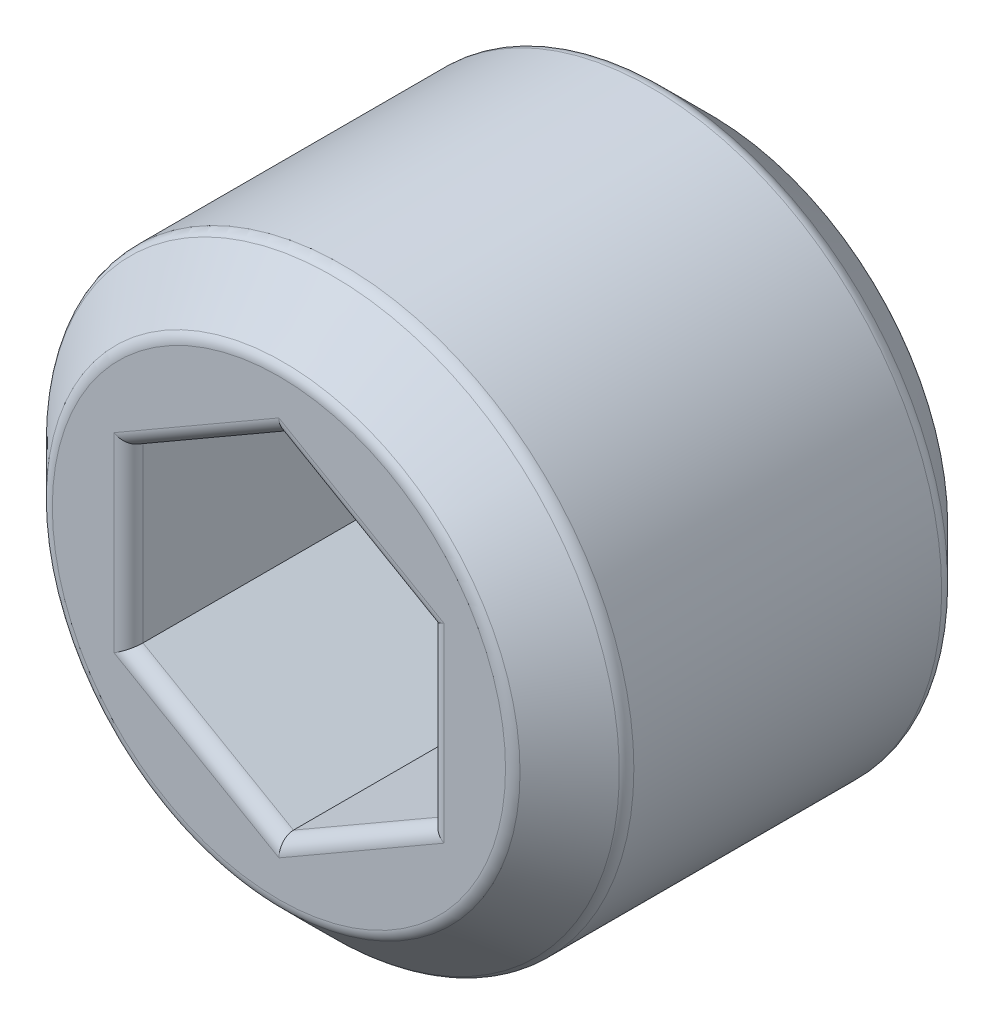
from build123d import *

# Parameters (mm, degrees)
ESQUISSE1_R             = 2
EXTRUSION1_DEPTH        = 3
CHANFREIN1_SIZE         = 0.4
ENL_V_MAT_EXTRU_1_DEPTH = 2
CONG_1_R                = 0.1


with BuildPart() as part:
    # Esquisse1 → Extrusion1 (new body)
    with BuildSketch(Plane.XY):
        with Locations(Location((0, 0, 0), (0, 0, 180))):
            Circle(ESQUISSE1_R)
    extrude(amount=EXTRUSION1_DEPTH)

    # Chanfrein1
    chanfrein1_edges = [part.edges().sort_by_distance(p)[0] for p in [
        (2, 0, 0),
        (2, 0, 3),
    ]]
    chamfer(chanfrein1_edges, length=CHANFREIN1_SIZE)

    # Esquisse2 → Enl_v. mat.-Extru.1 (cut)
    with BuildSketch(Plane.XY.offset(3)):
        Polygon((0, 1.194901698), (-1.034815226, 0.597450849), (-1.034815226, -0.597450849), (0, -1.194901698), (1.034815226, -0.597450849), (1.034815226, 0.597450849), align=None)
    extrude(amount=-ENL_V_MAT_EXTRU_1_DEPTH, mode=Mode.SUBTRACT)

    # Cong_1
    cong_1_edges = [part.edges().sort_by_distance(p)[0] for p in [
        (2, 0, 0.4),
        (2, 0, 2.6),
        (1.6, 0, 0),
        (1.6, 0, 3),
        (-0.517407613, 0.896176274, 3),
        (-1.034815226, 0, 3),
        (-0.517407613, -0.896176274, 3),
        (0.517407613, -0.896176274, 3),
        (1.034815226, 0, 3),
        (0.517407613, 0.896176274, 3),
    ]]
    fillet(cong_1_edges, radius=CONG_1_R)


solid = part.part
